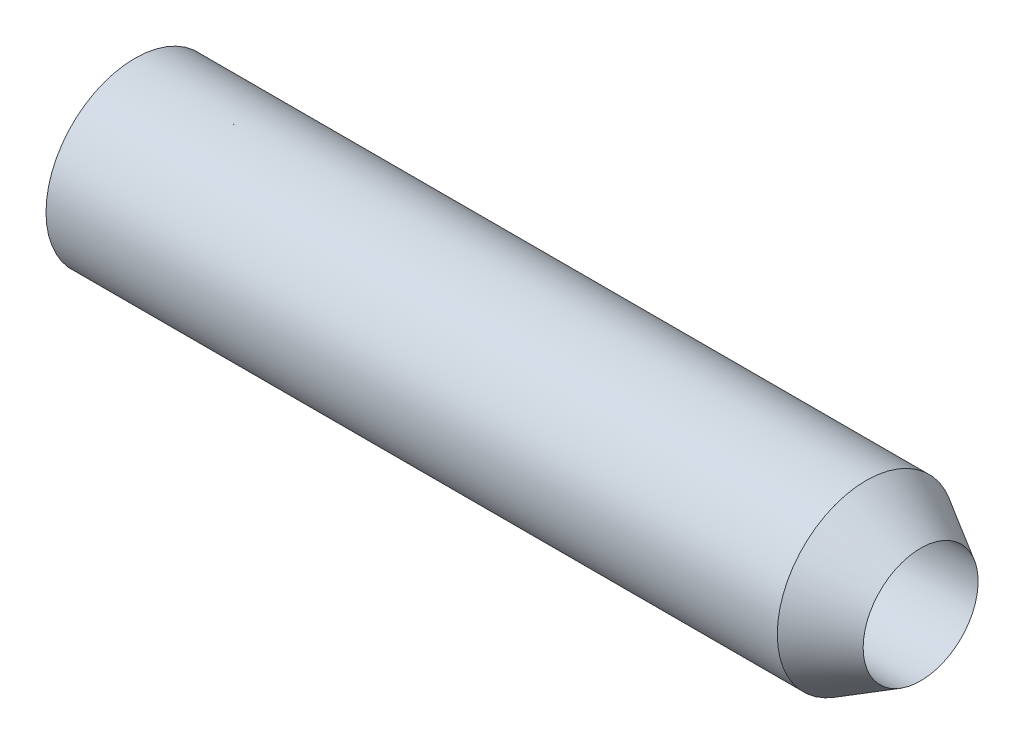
from build123d import *


with BuildPart() as part:
    # Sketch2 → Revolve2 (revolve)
    with BuildSketch(Plane.XY, mode=Mode.PRIVATE) as revolve2_sk:
        with BuildLine():
            Line((0, 0.6), (50, 3.658131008))
            Line((50, 3.658131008), (50, 5.658131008))
            Line((50, 5.658131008), (1.870676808, 2.714415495))
            ThreePointArc((1.870676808, 2.714415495), (0.497428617, 2.0446376), (0, 0.6))
        make_face()
    revolve(revolve2_sk.sketch.rotate(Axis((-19.275847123, 0, 0), (1, 0, 0)), 90), axis=Axis((-19.275847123, 0, 0), (1, 0, 0)))

    # Sketch4 → Revolve3 (revolve)
    with BuildSketch(Plane.XY, mode=Mode.PRIVATE) as revolve3_sk:
        with BuildLine():
            Line((112.60990337, 5.658131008), (120, 5.658131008))
            Line((120, 5.658131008), (120, 3.658131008))
            Line((120, 3.658131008), (112.60990337, 3.658131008))
            ThreePointArc((112.60990337, 3.658131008), (110.373835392, 2.658131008), (108.137767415, 3.658131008))
            ThreePointArc((108.137767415, 3.658131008), (105.901699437, 2.658131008), (103.66563146, 3.658131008))
            ThreePointArc((103.66563146, 3.658131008), (101.429563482, 2.658131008), (99.193495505, 3.658131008))
            ThreePointArc((99.193495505, 3.658131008), (96.957427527, 2.658131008), (94.72135955, 3.658131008))
            ThreePointArc((94.72135955, 3.658131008), (92.485291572, 2.658131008), (90.249223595, 3.658131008))
            ThreePointArc((90.249223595, 3.658131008), (88.013155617, 2.658131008), (85.77708764, 3.658131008))
            ThreePointArc((85.77708764, 3.658131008), (83.541019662, 2.658131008), (81.304951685, 3.658131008))
            ThreePointArc((81.304951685, 3.658131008), (79.068883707, 2.658131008), (76.83281573, 3.658131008))
            ThreePointArc((76.83281573, 3.658131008), (74.596747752, 2.658131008), (72.360679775, 3.658131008))
            ThreePointArc((72.360679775, 3.658131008), (70.124611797, 2.658131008), (67.88854382, 3.658131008))
            ThreePointArc((67.88854382, 3.658131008), (65.652475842, 2.658131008), (63.416407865, 3.658131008))
            ThreePointArc((63.416407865, 3.658131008), (61.180339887, 2.658131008), (58.94427191, 3.658131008))
            ThreePointArc((58.94427191, 3.658131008), (56.708203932, 2.658131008), (54.472135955, 3.658131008))
            ThreePointArc((54.472135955, 3.658131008), (52.236067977, 2.658131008), (50, 3.658131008))
            Line((50, 3.658131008), (50, 5.658131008))
            ThreePointArc((50, 5.658131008), (52.236067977, 6.658131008), (54.472135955, 5.658131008))
            ThreePointArc((54.472135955, 5.658131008), (56.708203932, 6.658131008), (58.94427191, 5.658131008))
            ThreePointArc((58.94427191, 5.658131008), (61.180339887, 6.658131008), (63.416407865, 5.658131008))
            ThreePointArc((63.416407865, 5.658131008), (65.652475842, 6.658131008), (67.88854382, 5.658131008))
            ThreePointArc((67.88854382, 5.658131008), (70.124611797, 6.658131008), (72.360679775, 5.658131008))
            ThreePointArc((72.360679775, 5.658131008), (74.596747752, 6.658131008), (76.83281573, 5.658131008))
            ThreePointArc((76.83281573, 5.658131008), (79.068883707, 6.658131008), (81.304951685, 5.658131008))
            ThreePointArc((81.304951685, 5.658131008), (83.541019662, 6.658131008), (85.77708764, 5.658131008))
            ThreePointArc((85.77708764, 5.658131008), (88.013155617, 6.658131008), (90.249223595, 5.658131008))
            ThreePointArc((90.249223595, 5.658131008), (92.485291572, 6.658131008), (94.72135955, 5.658131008))
            ThreePointArc((94.72135955, 5.658131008), (96.957427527, 6.658131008), (99.193495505, 5.658131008))
            ThreePointArc((99.193495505, 5.658131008), (101.429563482, 6.658131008), (103.66563146, 5.658131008))
            ThreePointArc((103.66563146, 5.658131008), (105.901699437, 6.658131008), (108.137767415, 5.658131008))
            ThreePointArc((108.137767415, 5.658131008), (110.373835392, 6.658131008), (112.60990337, 5.658131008))
        make_face()
    revolve(revolve3_sk.sketch.rotate(Axis((21.024758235, 0, 0), (1, 0, 0)), 90), axis=Axis((21.024758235, 0, 0), (1, 0, 0)))

    # Sketch5 → Revolve4 (revolve)
    with BuildSketch(Plane.XY, mode=Mode.PRIVATE) as revolve4_sk:
        Polygon((120, 3.658131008), (120, 5.658131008), (166.535898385, 5.658131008), (170, 3.658131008), align=None)
    revolve(revolve4_sk.sketch.rotate(Axis((115.901619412, 0, 0), (1, 0, 0)), 90), axis=Axis((115.901619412, 0, 0), (1, 0, 0)))

    # SurfaceCut1
    split(bisect_by=Plane(origin=(50, 0, 0), x_dir=(0, 0, -1), z_dir=(1, 0, 0)), keep=Keep.TOP)

    # SurfaceCut2
    split(bisect_by=Plane(origin=(120, 0, 0), x_dir=(0, 0, -1), z_dir=(1, 0, 0)), keep=Keep.TOP)


solid = part.part
